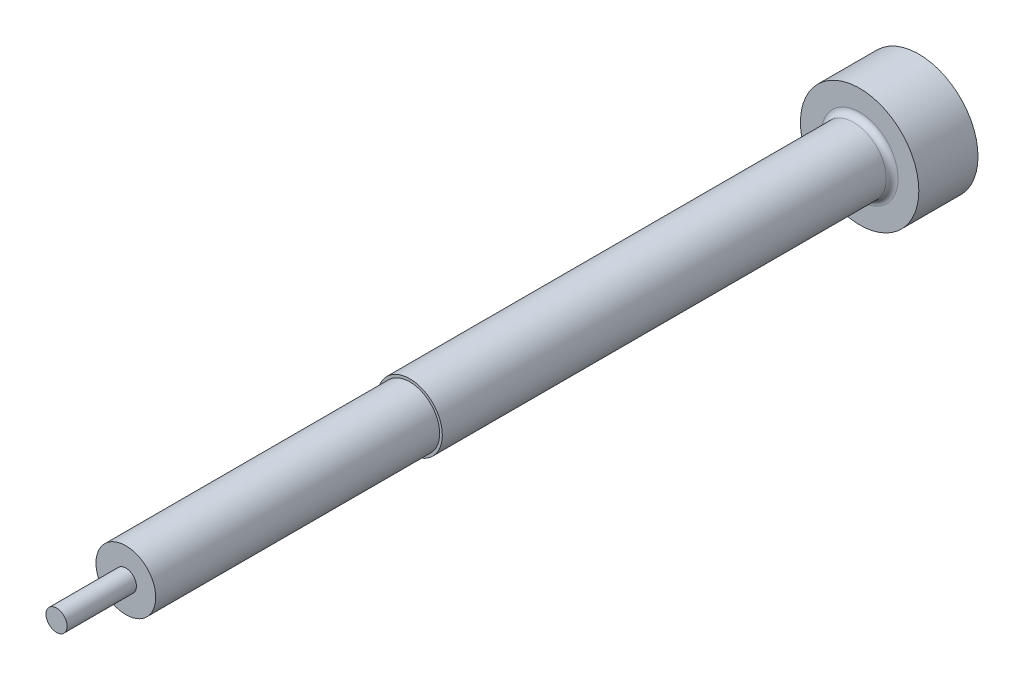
ISO-10303-21;
HEADER;
FILE_DESCRIPTION(('STEP AP214'),'2;1');
FILE_NAME('part.step','',(''),(''),'','','');
FILE_SCHEMA(('AUTOMOTIVE_DESIGN { 1 0 10303 214 1 1 1 1 }'));
ENDSEC;
DATA;
#1=APPLICATION_CONTEXT('core data for automotive mechanical design processes');
#2=APPLICATION_PROTOCOL_DEFINITION('international standard','automotive_design',2000,#1);
#3=PRODUCT_CONTEXT('',#1,'mechanical');
#4=PRODUCT('Part','Part','',(#3));
#5=PRODUCT_RELATED_PRODUCT_CATEGORY('part','',(#4));
#6=PRODUCT_DEFINITION_FORMATION('','',#4);
#7=PRODUCT_DEFINITION_CONTEXT('part definition',#1,'design');
#8=PRODUCT_DEFINITION('design','',#6,#7);
#9=PRODUCT_DEFINITION_SHAPE('','',#8);
#10=(LENGTH_UNIT() NAMED_UNIT(*) SI_UNIT(.MILLI.,.METRE.));
#11=(NAMED_UNIT(*) PLANE_ANGLE_UNIT() SI_UNIT($,.RADIAN.));
#12=(NAMED_UNIT(*) SI_UNIT($,.STERADIAN.) SOLID_ANGLE_UNIT());
#13=UNCERTAINTY_MEASURE_WITH_UNIT(LENGTH_MEASURE(1.E-05),#10,'distance_accuracy_value','');
#14=(GEOMETRIC_REPRESENTATION_CONTEXT(3) GLOBAL_UNCERTAINTY_ASSIGNED_CONTEXT((#13)) GLOBAL_UNIT_ASSIGNED_CONTEXT((#10,
#11,#12)) REPRESENTATION_CONTEXT('',''));
#15=CARTESIAN_POINT('',(0.,0.,0.));
#16=DIRECTION('',(0.,0.,1.));
#17=DIRECTION('',(1.,0.,0.));
#18=AXIS2_PLACEMENT_3D('',#15,#16,#17);
#19=CARTESIAN_POINT('',(0.,0.,203.111269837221));
#20=DIRECTION('',(0.,0.,-1.));
#21=DIRECTION('',(-1.,0.,0.));
#22=AXIS2_PLACEMENT_3D('',#19,#20,#21);
#23=CYLINDRICAL_SURFACE('',#22,1.1);
#24=CARTESIAN_POINT('',(0.,0.,2.20000000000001));
#25=DIRECTION('',(0.,0.,1.));
#26=DIRECTION('',(1.,0.,0.));
#27=AXIS2_PLACEMENT_3D('',#24,#25,#26);
#28=CIRCLE('',#27,1.1);
#29=CARTESIAN_POINT('',(1.1,0.,2.20000000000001));
#30=VERTEX_POINT('',#29);
#31=EDGE_CURVE('E42',#30,#30,#28,.T.);
#32=ORIENTED_EDGE('',*,*,#31,.T.);
#33=EDGE_LOOP('',(#32));
#34=FACE_BOUND('',#33,.T.);
#35=CARTESIAN_POINT('',(0.,0.,17.2));
#36=DIRECTION('',(0.,0.,1.));
#37=DIRECTION('',(1.,0.,0.));
#38=AXIS2_PLACEMENT_3D('',#35,#36,#37);
#39=CIRCLE('',#38,1.1);
#40=CARTESIAN_POINT('',(1.1,0.,17.2));
#41=VERTEX_POINT('',#40);
#42=EDGE_CURVE('E33',#41,#41,#39,.T.);
#43=ORIENTED_EDGE('',*,*,#42,.F.);
#44=EDGE_LOOP('',(#43));
#45=FACE_BOUND('',#44,.T.);
#46=ADVANCED_FACE('F30',(#34,#45),#23,.T.);
#47=CARTESIAN_POINT('',(0.,0.,2.));
#48=DIRECTION('',(0.,0.,1.));
#49=DIRECTION('',(1.,0.,0.));
#50=AXIS2_PLACEMENT_3D('',#47,#48,#49);
#51=PLANE('',#50);
#52=CARTESIAN_POINT('',(0.,0.,2.));
#53=DIRECTION('',(0.,0.,1.));
#54=DIRECTION('',(1.,0.,0.));
#55=AXIS2_PLACEMENT_3D('',#52,#53,#54);
#56=CIRCLE('',#55,1.3);
#57=CARTESIAN_POINT('',(1.3,0.,2.));
#58=VERTEX_POINT('',#57);
#59=EDGE_CURVE('E53',#58,#58,#56,.F.);
#60=ORIENTED_EDGE('',*,*,#59,.T.);
#61=EDGE_LOOP('',(#60));
#62=FACE_BOUND('',#61,.T.);
#63=CARTESIAN_POINT('',(0.,0.,2.));
#64=DIRECTION('',(0.,0.,1.));
#65=DIRECTION('',(1.,0.,0.));
#66=AXIS2_PLACEMENT_3D('',#63,#64,#65);
#67=CIRCLE('',#66,2.);
#68=CARTESIAN_POINT('',(2.,0.,2.));
#69=VERTEX_POINT('',#68);
#70=EDGE_CURVE('E61',#69,#69,#67,.T.);
#71=ORIENTED_EDGE('',*,*,#70,.T.);
#72=EDGE_LOOP('',(#71));
#73=FACE_BOUND('',#72,.T.);
#74=ADVANCED_FACE('F82',(#62,#73),#51,.T.);
#75=CARTESIAN_POINT('',(0.,0.,2.));
#76=DIRECTION('',(0.,0.,-1.));
#77=DIRECTION('',(-1.,0.,0.));
#78=AXIS2_PLACEMENT_3D('',#75,#76,#77);
#79=CYLINDRICAL_SURFACE('',#78,2.);
#80=ORIENTED_EDGE('',*,*,#70,.F.);
#81=EDGE_LOOP('',(#80));
#82=FACE_BOUND('',#81,.T.);
#83=CARTESIAN_POINT('',(0.,0.,0.));
#84=DIRECTION('',(0.,0.,1.));
#85=DIRECTION('',(1.,0.,0.));
#86=AXIS2_PLACEMENT_3D('',#83,#84,#85);
#87=CIRCLE('',#86,2.);
#88=CARTESIAN_POINT('',(2.,0.,0.));
#89=VERTEX_POINT('',#88);
#90=EDGE_CURVE('E45',#89,#89,#87,.T.);
#91=ORIENTED_EDGE('',*,*,#90,.T.);
#92=EDGE_LOOP('',(#91));
#93=FACE_BOUND('',#92,.T.);
#94=ADVANCED_FACE('F69',(#82,#93),#79,.T.);
#95=CARTESIAN_POINT('',(0.,0.,0.));
#96=DIRECTION('',(0.,0.,1.));
#97=DIRECTION('',(1.,0.,0.));
#98=AXIS2_PLACEMENT_3D('',#95,#96,#97);
#99=PLANE('',#98);
#100=ORIENTED_EDGE('',*,*,#90,.F.);
#101=EDGE_LOOP('',(#100));
#102=FACE_BOUND('',#101,.T.);
#103=ADVANCED_FACE('F71',(#102),#99,.F.);
#104=CARTESIAN_POINT('',(0.,0.,2.20000000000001));
#105=DIRECTION('',(0.,0.,1.));
#106=DIRECTION('',(1.,0.,0.));
#107=AXIS2_PLACEMENT_3D('',#104,#105,#106);
#108=TOROIDAL_SURFACE('',#107,1.3,0.2);
#109=ORIENTED_EDGE('',*,*,#59,.F.);
#110=EDGE_LOOP('',(#109));
#111=FACE_BOUND('',#110,.T.);
#112=ORIENTED_EDGE('',*,*,#31,.F.);
#113=EDGE_LOOP('',(#112));
#114=FACE_BOUND('',#113,.T.);
#115=ADVANCED_FACE('F73',(#111,#114),#108,.F.);
#116=CARTESIAN_POINT('',(32.9313465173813,34.0031938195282,17.2));
#117=DIRECTION('',(0.,0.,1.));
#118=DIRECTION('',(0.952817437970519,0.303543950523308,0.));
#119=AXIS2_PLACEMENT_3D('',#116,#117,#118);
#120=PLANE('',#119);
#121=CARTESIAN_POINT('',(0.,0.,17.2));
#122=DIRECTION('',(0.,0.,1.));
#123=DIRECTION('',(1.,0.,0.));
#124=AXIS2_PLACEMENT_3D('',#121,#122,#123);
#125=CIRCLE('',#124,1.00961168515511);
#126=CARTESIAN_POINT('',(1.00961168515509,0.,17.2));
#127=VERTEX_POINT('',#126);
#128=EDGE_CURVE('E49',#127,#127,#125,.F.);
#129=ORIENTED_EDGE('',*,*,#128,.T.);
#130=EDGE_LOOP('',(#129));
#131=FACE_BOUND('',#130,.T.);
#132=ORIENTED_EDGE('',*,*,#42,.T.);
#133=EDGE_LOOP('',(#132));
#134=FACE_BOUND('',#133,.T.);
#135=ADVANCED_FACE('F79',(#131,#134),#120,.T.);
#136=CARTESIAN_POINT('',(0.,0.,1.4865772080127));
#137=DIRECTION('',(0.,0.,1.));
#138=DIRECTION('',(1.,0.,0.));
#139=AXIS2_PLACEMENT_3D('',#136,#137,#138);
#140=CYLINDRICAL_SURFACE('',#139,1.00961168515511);
#141=ORIENTED_EDGE('',*,*,#128,.F.);
#142=EDGE_LOOP('',(#141));
#143=FACE_BOUND('',#142,.T.);
#144=CARTESIAN_POINT('',(0.,0.,26.7926));
#145=DIRECTION('',(0.,0.,-1.));
#146=DIRECTION('',(-1.,0.,0.));
#147=AXIS2_PLACEMENT_3D('',#144,#145,#146);
#148=CIRCLE('',#147,1.00961168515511);
#149=CARTESIAN_POINT('',(-1.00961168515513,0.,26.7926));
#150=VERTEX_POINT('',#149);
#151=EDGE_CURVE('E47',#150,#150,#148,.T.);
#152=ORIENTED_EDGE('',*,*,#151,.T.);
#153=EDGE_LOOP('',(#152));
#154=FACE_BOUND('',#153,.T.);
#155=ADVANCED_FACE('F97',(#143,#154),#140,.T.);
#156=CARTESIAN_POINT('',(0.,0.,29.13515));
#157=DIRECTION('',(0.,0.,-1.));
#158=DIRECTION('',(-0.952817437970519,-0.303543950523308,0.));
#159=AXIS2_PLACEMENT_3D('',#156,#157,#158);
#160=PLANE('',#159);
#161=CARTESIAN_POINT('',(0.,0.,29.13515));
#162=DIRECTION('',(0.,0.,-1.));
#163=DIRECTION('',(-0.952817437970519,-0.303543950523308,0.));
#164=AXIS2_PLACEMENT_3D('',#161,#162,#163);
#165=CIRCLE('',#164,0.356475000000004);
#166=CARTESIAN_POINT('',(-0.339655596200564,-0.10820582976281,29.13515));
#167=VERTEX_POINT('',#166);
#168=EDGE_CURVE('E11',#167,#167,#165,.T.);
#169=ORIENTED_EDGE('',*,*,#168,.F.);
#170=EDGE_LOOP('',(#169));
#171=FACE_BOUND('',#170,.T.);
#172=ADVANCED_FACE('F102',(#171),#160,.F.);
#173=CARTESIAN_POINT('',(0.,0.,29.13515));
#174=DIRECTION('',(0.,0.,-1.));
#175=DIRECTION('',(-0.952817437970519,-0.303543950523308,0.));
#176=AXIS2_PLACEMENT_3D('',#173,#174,#175);
#177=CYLINDRICAL_SURFACE('',#176,0.356475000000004);
#178=ORIENTED_EDGE('',*,*,#168,.T.);
#179=EDGE_LOOP('',(#178));
#180=FACE_BOUND('',#179,.T.);
#181=CARTESIAN_POINT('',(0.,0.,26.7926));
#182=DIRECTION('',(0.,0.,-1.));
#183=DIRECTION('',(-0.952817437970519,-0.303543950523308,0.));
#184=AXIS2_PLACEMENT_3D('',#181,#182,#183);
#185=CIRCLE('',#184,0.356475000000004);
#186=CARTESIAN_POINT('',(-0.339655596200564,-0.10820582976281,26.7926));
#187=VERTEX_POINT('',#186);
#188=EDGE_CURVE('E37',#187,#187,#185,.T.);
#189=ORIENTED_EDGE('',*,*,#188,.F.);
#190=EDGE_LOOP('',(#189));
#191=FACE_BOUND('',#190,.T.);
#192=ADVANCED_FACE('F108',(#180,#191),#177,.T.);
#193=CARTESIAN_POINT('',(0.,0.,26.7926));
#194=DIRECTION('',(0.,0.,-1.));
#195=DIRECTION('',(-0.952817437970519,-0.303543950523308,0.));
#196=AXIS2_PLACEMENT_3D('',#193,#194,#195);
#197=PLANE('',#196);
#198=ORIENTED_EDGE('',*,*,#188,.T.);
#199=EDGE_LOOP('',(#198));
#200=FACE_BOUND('',#199,.T.);
#201=ORIENTED_EDGE('',*,*,#151,.F.);
#202=EDGE_LOOP('',(#201));
#203=FACE_BOUND('',#202,.T.);
#204=ADVANCED_FACE('F113',(#200,#203),#197,.F.);
#205=CLOSED_SHELL('',(#46,#74,#94,#103,#115,#135,#155,#172,#192,#204));
#206=MANIFOLD_SOLID_BREP('B2',#205);
#207=ADVANCED_BREP_SHAPE_REPRESENTATION('',(#18,#206),#14);
#208=SHAPE_DEFINITION_REPRESENTATION(#9,#207);
ENDSEC;
END-ISO-10303-21;
